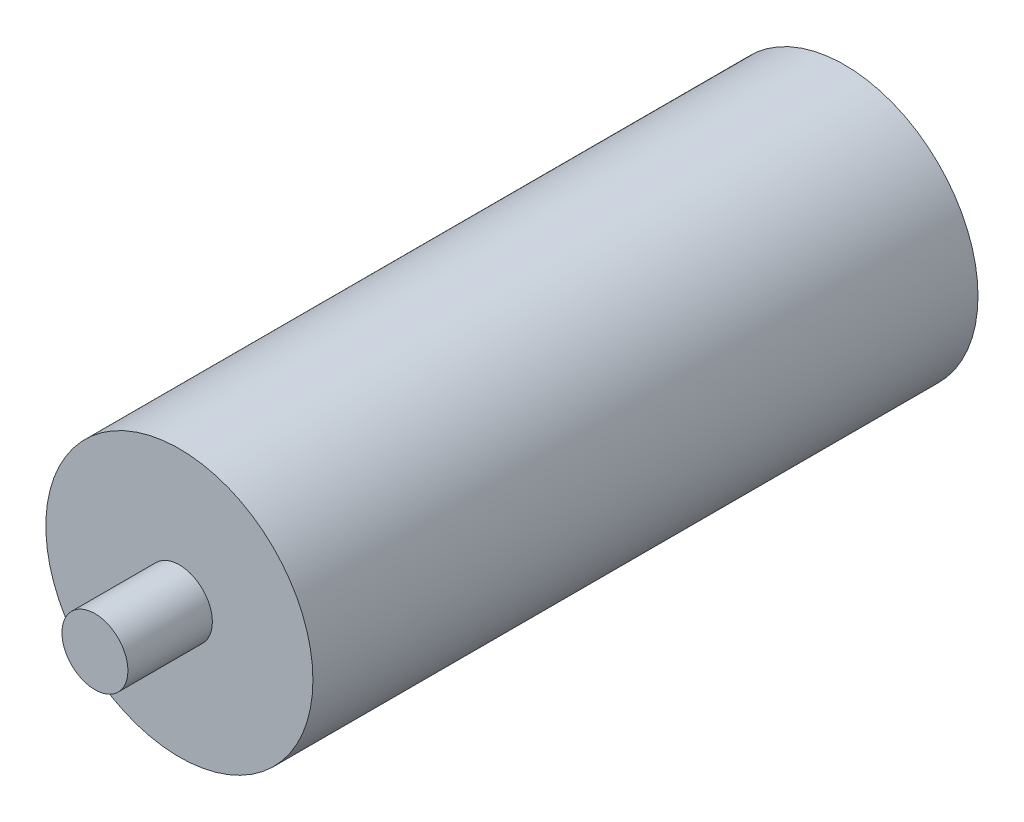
ISO-10303-21;
HEADER;
FILE_DESCRIPTION(('STEP AP214'),'2;1');
FILE_NAME('part.step','',(''),(''),'','','');
FILE_SCHEMA(('AUTOMOTIVE_DESIGN { 1 0 10303 214 1 1 1 1 }'));
ENDSEC;
DATA;
#1=APPLICATION_CONTEXT('core data for automotive mechanical design processes');
#2=APPLICATION_PROTOCOL_DEFINITION('international standard','automotive_design',2000,#1);
#3=PRODUCT_CONTEXT('',#1,'mechanical');
#4=PRODUCT('Part','Part','',(#3));
#5=PRODUCT_RELATED_PRODUCT_CATEGORY('part','',(#4));
#6=PRODUCT_DEFINITION_FORMATION('','',#4);
#7=PRODUCT_DEFINITION_CONTEXT('part definition',#1,'design');
#8=PRODUCT_DEFINITION('design','',#6,#7);
#9=PRODUCT_DEFINITION_SHAPE('','',#8);
#10=(LENGTH_UNIT() NAMED_UNIT(*) SI_UNIT(.MILLI.,.METRE.));
#11=(NAMED_UNIT(*) PLANE_ANGLE_UNIT() SI_UNIT($,.RADIAN.));
#12=(NAMED_UNIT(*) SI_UNIT($,.STERADIAN.) SOLID_ANGLE_UNIT());
#13=UNCERTAINTY_MEASURE_WITH_UNIT(LENGTH_MEASURE(1.E-05),#10,'distance_accuracy_value','');
#14=(GEOMETRIC_REPRESENTATION_CONTEXT(3) GLOBAL_UNCERTAINTY_ASSIGNED_CONTEXT((#13)) GLOBAL_UNIT_ASSIGNED_CONTEXT((#10,
#11,#12)) REPRESENTATION_CONTEXT('',''));
#15=CARTESIAN_POINT('',(0.,0.,0.));
#16=DIRECTION('',(0.,0.,1.));
#17=DIRECTION('',(1.,0.,0.));
#18=AXIS2_PLACEMENT_3D('',#15,#16,#17);
#19=CARTESIAN_POINT('',(0.,0.,160.02));
#20=DIRECTION('',(0.,0.,1.));
#21=DIRECTION('',(1.,0.,0.));
#22=AXIS2_PLACEMENT_3D('',#19,#20,#21);
#23=PLANE('',#22);
#24=CARTESIAN_POINT('',(0.,0.,160.02));
#25=DIRECTION('',(0.,0.,1.));
#26=DIRECTION('',(1.,0.,0.));
#27=AXIS2_PLACEMENT_3D('',#24,#25,#26);
#28=CIRCLE('',#27,32.131);
#29=CARTESIAN_POINT('',(32.131,0.,160.02));
#30=VERTEX_POINT('',#29);
#31=EDGE_CURVE('E10',#30,#30,#28,.T.);
#32=ORIENTED_EDGE('',*,*,#31,.T.);
#33=EDGE_LOOP('',(#32));
#34=FACE_BOUND('',#33,.T.);
#35=CARTESIAN_POINT('',(0.,0.,160.02));
#36=DIRECTION('',(0.,0.,1.));
#37=DIRECTION('',(1.,0.,0.));
#38=AXIS2_PLACEMENT_3D('',#35,#36,#37);
#39=CIRCLE('',#38,7.9375);
#40=CARTESIAN_POINT('',(7.9375,0.,160.02));
#41=VERTEX_POINT('',#40);
#42=EDGE_CURVE('E41',#41,#41,#39,.T.);
#43=ORIENTED_EDGE('',*,*,#42,.F.);
#44=EDGE_LOOP('',(#43));
#45=FACE_BOUND('',#44,.T.);
#46=ADVANCED_FACE('F28',(#34,#45),#23,.T.);
#47=CARTESIAN_POINT('',(0.,0.,160.02));
#48=DIRECTION('',(0.,0.,-1.));
#49=DIRECTION('',(-1.,0.,0.));
#50=AXIS2_PLACEMENT_3D('',#47,#48,#49);
#51=CYLINDRICAL_SURFACE('',#50,32.131);
#52=ORIENTED_EDGE('',*,*,#31,.F.);
#53=EDGE_LOOP('',(#52));
#54=FACE_BOUND('',#53,.T.);
#55=CARTESIAN_POINT('',(0.,0.,0.));
#56=DIRECTION('',(0.,0.,1.));
#57=DIRECTION('',(1.,0.,0.));
#58=AXIS2_PLACEMENT_3D('',#55,#56,#57);
#59=CIRCLE('',#58,32.131);
#60=CARTESIAN_POINT('',(32.131,0.,0.));
#61=VERTEX_POINT('',#60);
#62=EDGE_CURVE('E32',#61,#61,#59,.T.);
#63=ORIENTED_EDGE('',*,*,#62,.T.);
#64=EDGE_LOOP('',(#63));
#65=FACE_BOUND('',#64,.T.);
#66=ADVANCED_FACE('F30',(#54,#65),#51,.T.);
#67=CARTESIAN_POINT('',(0.,0.,0.));
#68=DIRECTION('',(0.,0.,1.));
#69=DIRECTION('',(1.,0.,0.));
#70=AXIS2_PLACEMENT_3D('',#67,#68,#69);
#71=PLANE('',#70);
#72=ORIENTED_EDGE('',*,*,#62,.F.);
#73=EDGE_LOOP('',(#72));
#74=FACE_BOUND('',#73,.T.);
#75=ADVANCED_FACE('F52',(#74),#71,.F.);
#76=CARTESIAN_POINT('',(0.,0.,180.34));
#77=DIRECTION('',(0.,0.,-1.));
#78=DIRECTION('',(-1.,0.,0.));
#79=AXIS2_PLACEMENT_3D('',#76,#77,#78);
#80=CYLINDRICAL_SURFACE('',#79,7.9375);
#81=CARTESIAN_POINT('',(0.,0.,180.34));
#82=DIRECTION('',(0.,0.,1.));
#83=DIRECTION('',(1.,0.,0.));
#84=AXIS2_PLACEMENT_3D('',#81,#82,#83);
#85=CIRCLE('',#84,7.9375);
#86=CARTESIAN_POINT('',(7.9375,0.,180.34));
#87=VERTEX_POINT('',#86);
#88=EDGE_CURVE('E39',#87,#87,#85,.T.);
#89=ORIENTED_EDGE('',*,*,#88,.F.);
#90=EDGE_LOOP('',(#89));
#91=FACE_BOUND('',#90,.T.);
#92=ORIENTED_EDGE('',*,*,#42,.T.);
#93=EDGE_LOOP('',(#92));
#94=FACE_BOUND('',#93,.T.);
#95=ADVANCED_FACE('F49',(#91,#94),#80,.T.);
#96=CARTESIAN_POINT('',(0.,0.,180.34));
#97=DIRECTION('',(0.,0.,1.));
#98=DIRECTION('',(1.,0.,0.));
#99=AXIS2_PLACEMENT_3D('',#96,#97,#98);
#100=PLANE('',#99);
#101=ORIENTED_EDGE('',*,*,#88,.T.);
#102=EDGE_LOOP('',(#101));
#103=FACE_BOUND('',#102,.T.);
#104=ADVANCED_FACE('F47',(#103),#100,.T.);
#105=CLOSED_SHELL('',(#46,#66,#75,#95,#104));
#106=MANIFOLD_SOLID_BREP('B2',#105);
#107=ADVANCED_BREP_SHAPE_REPRESENTATION('',(#18,#106),#14);
#108=SHAPE_DEFINITION_REPRESENTATION(#9,#107);
ENDSEC;
END-ISO-10303-21;
